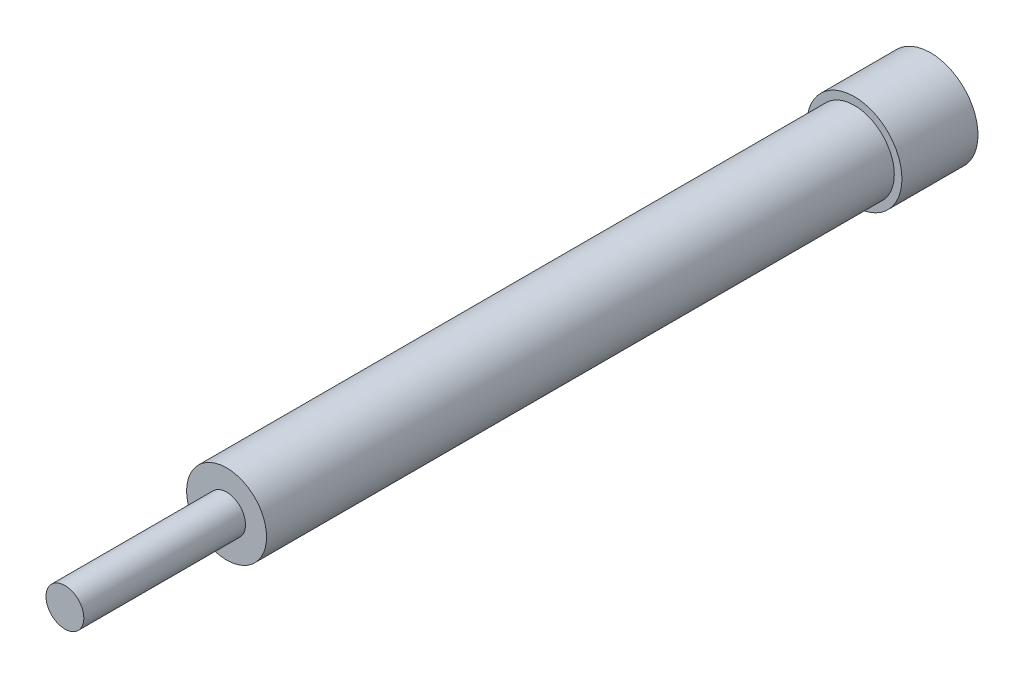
from build123d import *

# Parameters (mm, degrees)
SKIZZE1_R                       = 25
BASIS_LINEAR_AUSTRAGEN_DEPTH    = 40
SKIZZE2_R                       = 21
AUFSATZ_LINEAR_AUSTRAGEN1_DEPTH = 330
SKIZZE3_R                       = 9.95
AUFSATZ_LINEAR_AUSTRAGEN2_DEPTH = 85


with BuildPart() as part:
    # Skizze1 → Basis-Linear austragen (new body)
    with BuildSketch(Plane.XY):
        Circle(SKIZZE1_R)
    extrude(amount=-BASIS_LINEAR_AUSTRAGEN_DEPTH)

    # Skizze2 → Aufsatz-Linear austragen1 (add)
    with BuildSketch(Plane.XY):
        Circle(SKIZZE2_R)
    extrude(amount=AUFSATZ_LINEAR_AUSTRAGEN1_DEPTH)

    # Skizze3 → Aufsatz-Linear austragen2 (add)
    with BuildSketch(Plane.XY.offset(330)):
        Circle(SKIZZE3_R)
    extrude(amount=AUFSATZ_LINEAR_AUSTRAGEN2_DEPTH)


solid = part.part
